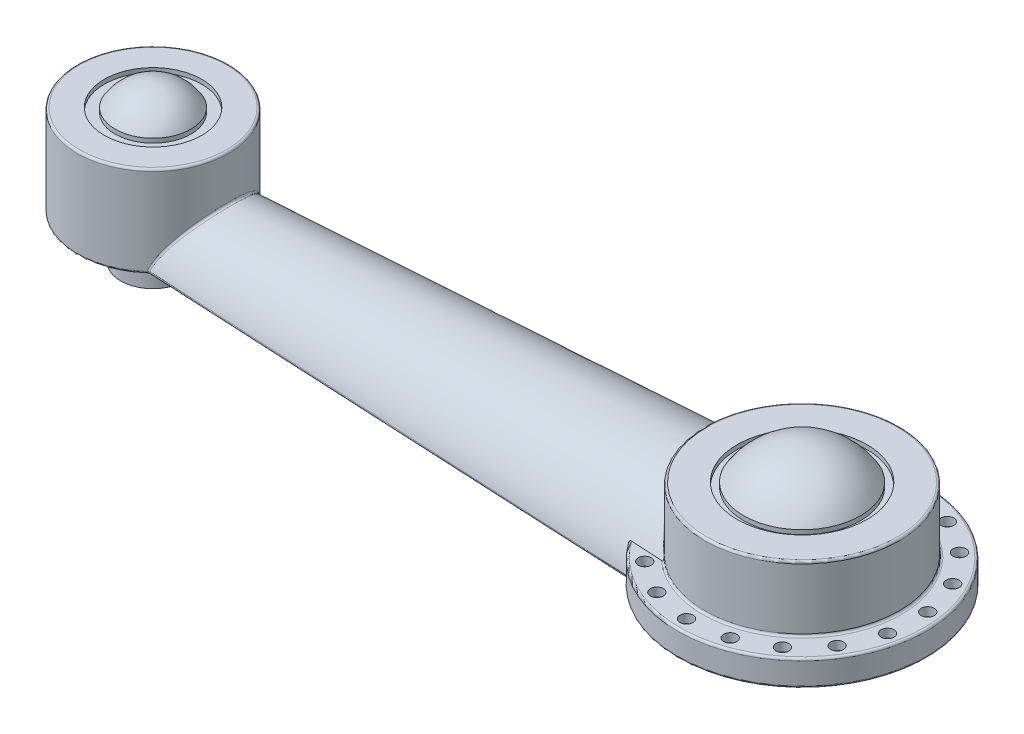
from build123d import *

# Parameters (mm, degrees)
SKETCH1_R           = 57.5
BOSS_EXTRUDE1_DEPTH = 12
SKETCH2_R           = 45
BOSS_EXTRUDE2_DEPTH = 30
SKETCH3_R           = 30
SKETCH3_R_2         = 27
CUT_EXTRUDE1_DEPTH  = 2
SKETCH4_R           = 35
BOSS_EXTRUDE3_DEPTH = 42
SKETCH5_R           = 22.5
SKETCH5_R_2         = 17.5
CUT_EXTRUDE2_DEPTH  = 2
CUT_EXTRUDE4_START  = -30
SKETCH13_R          = 3
CUT_EXTRUDE4_DEPTH  = 4
DOME2_FACE_RADIUS   = 17.5
DOME2_HEIGHT        = 10
DOME3_FACE_RADIUS   = 27
DOME3_HEIGHT        = 15
SKETCH14_R          = 15
BOSS_EXTRUDE4_DEPTH = 20
FILLET1_R           = 1


with BuildPart() as part:
    # Sketch1 → Boss-Extrude1 (new body)
    with BuildSketch(Plane(origin=(0, 0, 0), x_dir=(1, 0, 0), z_dir=(0, 1, 0))):
        with Locations(Location((0, 0, 0), (0, 0, 270))):
            Circle(SKETCH1_R)
    extrude(amount=BOSS_EXTRUDE1_DEPTH)

    # Sketch2 → Boss-Extrude2 (add)
    with BuildSketch(Plane(origin=(0, 12, 0), x_dir=(1, 0, 0), z_dir=(0, 1, 0))):
        with Locations(Location((0, 0, 0), (0, 0, 270))):
            Circle(SKETCH2_R)
    extrude(amount=BOSS_EXTRUDE2_DEPTH)

    # Sketch3 → Cut-Extrude1 (cut)
    with BuildSketch(Plane(origin=(0, 42, 0), x_dir=(1, 0, 0), z_dir=(0, 1, 0))):
        with Locations(Location((0, 0, 0), (0, 0, 270))):
            Circle(SKETCH3_R)
        with Locations(Location((0, 0, 0), (0, 0, 270))):
            Circle(SKETCH3_R_2, mode=Mode.SUBTRACT)
    extrude(amount=-CUT_EXTRUDE1_DEPTH, mode=Mode.SUBTRACT)



with BuildPart() as body_2:
    # Sketch4 → Boss-Extrude3 (new body)
    with BuildSketch(Plane(origin=(0, 42, 0), x_dir=(1, 0, 0), z_dir=(0, 1, 0))):
        with Locations(Location((-300, 0, 0), (0, 0, 270))):
            Circle(SKETCH4_R)
    extrude(amount=-BOSS_EXTRUDE3_DEPTH)

    # Sketch5 → Cut-Extrude2 (cut)
    with BuildSketch(Plane(origin=(0, 42, 0), x_dir=(1, 0, 0), z_dir=(0, 1, 0))):
        with Locations(Location((-300, 0, 0), (0, 0, 270))):
            Circle(SKETCH5_R)
        with Locations(Location((-300, 0, 0), (0, 0, 270))):
            Circle(SKETCH5_R_2, mode=Mode.SUBTRACT)
    extrude(amount=-CUT_EXTRUDE2_DEPTH, mode=Mode.SUBTRACT)


with BuildPart() as part_1:
    add(part.part)

    add(body_2.part)  # Loft1 merges body 2
    # Sketch11 for Loft1 → Loft1 section 0
    with BuildSketch(Plane(origin=(0, 0, 0), x_dir=(0, 0, -1), z_dir=(1, 0, 0))):
        with BuildLine():
            Line((-39.5, 0), (39.5, 0))
            # circular arc as an exact rational Bezier (weights 1, cos(half-angle), 1)
            Bezier((39.5, 0), (0, 247.471747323), (-39.5, 0), weights=[1, 0.157619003, 1])
        make_face()
    # Sketch10 for Loft1 → Loft1 section 1
    with BuildSketch(Plane(origin=(-300, 0, 0), x_dir=(0, 0, -1), z_dir=(1, 0, 0))):
        with BuildLine():
            Line((-25, 0), (25, 0))
            Bezier((25, 0), (0, 87.517505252), (-25, 0), weights=[1, 0.274670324, 1])
        make_face()
    loft()

    # Sketch13 → Cut-Extrude4 (cut)
    with BuildSketch(Plane(origin=(0, 42, 0), x_dir=(1, 0, 0), z_dir=(0, 1, 0)).offset(CUT_EXTRUDE4_START)):
        with Locations(Location((-31.59050869, 40.672961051, 0), (0, 0, 270))):
            Circle(SKETCH13_R)
        with Locations(Location((-15.774395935, 49.024671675, 0), (0, 0, 270))):
            Circle(SKETCH13_R)
        with Locations(Location((1.944341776, 51.463283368, 0), (0, 0, 270))):
            Circle(SKETCH13_R)
        with Locations(Location((19.428563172, 47.69466357, 0), (0, 0, 270))):
            Circle(SKETCH13_R)
        with Locations(Location((34.569413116, 38.173363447, 0), (0, 0, 270))):
            Circle(SKETCH13_R)
        with Locations(Location((45.540681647, 24.047792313, 0), (0, 0, 270))):
            Circle(SKETCH13_R)
        with Locations(Location((51.019071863, 7.021702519, 0), (0, 0, 270))):
            Circle(SKETCH13_R)
        with Locations(Location((50.343809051, -10.851308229, 0), (0, 0, 270))):
            Circle(SKETCH13_R)
        with Locations(Location((43.596339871, -27.415491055, 0), (0, 0, 270))):
            Circle(SKETCH13_R)
        with Locations(Location((31.59050869, -40.672961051, 0), (0, 0, 270))):
            Circle(SKETCH13_R)
        with Locations(Location((15.774395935, -49.024671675, 0), (0, 0, 270))):
            Circle(SKETCH13_R)
        with Locations(Location((-1.944341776, -51.463283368, 0), (0, 0, 270))):
            Circle(SKETCH13_R)
        with Locations(Location((-19.428563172, -47.69466357, 0), (0, 0, 270))):
            Circle(SKETCH13_R)
        with Locations(Location((-34.569413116, -38.173363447, 0), (0, 0, 270))):
            Circle(SKETCH13_R)
    extrude(amount=-CUT_EXTRUDE4_DEPTH, mode=Mode.SUBTRACT)

    # Dome2: a dome of height H over a round flat face of radius A is a cap of a sphere of radius (A * A + H * H) / (2 * H)
    dome2_r = (DOME2_FACE_RADIUS * DOME2_FACE_RADIUS + DOME2_HEIGHT * DOME2_HEIGHT) / (2 * DOME2_HEIGHT)
    dome2_base = Plane((-300, 42, 0), z_dir=(0, 1, 0))
    with Locations(dome2_base.offset(DOME2_HEIGHT - dome2_r)):
        dome2_ball = Sphere(dome2_r, mode=Mode.PRIVATE)
    add(split(dome2_ball, bisect_by=dome2_base, keep=Keep.TOP, mode=Mode.PRIVATE))

    # Dome3: a dome of height H over a round flat face of radius A is a cap of a sphere of radius (A * A + H * H) / (2 * H)
    dome3_r = (DOME3_FACE_RADIUS * DOME3_FACE_RADIUS + DOME3_HEIGHT * DOME3_HEIGHT) / (2 * DOME3_HEIGHT)
    dome3_base = Plane((0, 42, 0), z_dir=(0, 1, 0))
    with Locations(dome3_base.offset(DOME3_HEIGHT - dome3_r)):
        dome3_ball = Sphere(dome3_r, mode=Mode.PRIVATE)
    add(split(dome3_ball, bisect_by=dome3_base, keep=Keep.TOP, mode=Mode.PRIVATE))

    # Sketch14 → Boss-Extrude4 (add)
    with BuildSketch(Plane.XZ):
        with Locations(Location((-300, 0, 0), (0, 0, 90))):
            Circle(SKETCH14_R)
        with Locations(Location((0, 0, 0), (0, 0, 90))):
            Circle(SKETCH14_R)
    extrude(amount=BOSS_EXTRUDE4_DEPTH)

    # Fillet1
    fillet1_edges = [part_1.edges().sort_by_distance(p)[0] for p in [
        (-160.197049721, 0, 31.757142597),
        (-160.197049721, 0, -31.757142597),
        (-300, 42, -35),
        (-265, 20.589516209, 0),
        (-332.706266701, 0, -12.461946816),
        (42.146727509, 12, -15.768746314),
        (0, 42, -45),
        (-45, 31.469739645, 0),
        (57.5, 0, 0),
        (57.5, 12, 0),
    ]]
    fillet(fillet1_edges, radius=FILLET1_R)


solid = part_1.part
